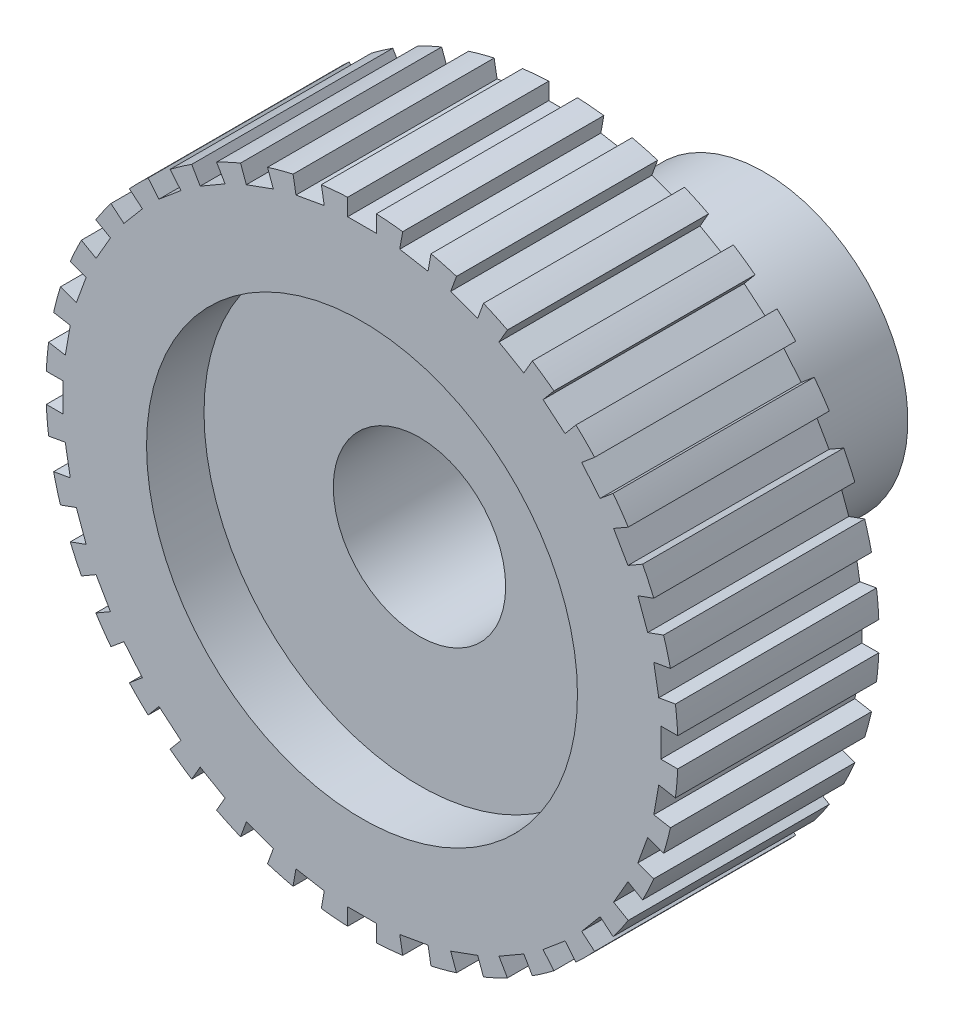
from build123d import *

# Parameters (mm, degrees)
ESQUISSE1_R                  = 11
BASE_EXTRUSION_DEPTH         = 7
ESQUISSE2_R                  = 7.5
ENL_V_MAT_EXTRU_1_DEPTH      = 2
ENL_V_START                  = -1
ESQUISSE3_R                  = 7.5
ENL_V_MAT_EXTRU_2_DEPTH      = 1
ESQUISSE4_R                  = 5
BOSS_EXTRU_1_DEPTH           = 8
ESQUISSE5_R                  = 3
ENL_V_MAT_EXTRU_3_DEPTH      = 18
ESQUISSE6_W                  = 1
ESQUISSE6_H                  = 1
ENL_V_MAT_EXTRU_4_DEPTH      = 18
R_P_TITION_CIRCULAIRE1_COUNT = 36


with BuildPart() as part:
    # Esquisse1 → Base-Extrusion (new body)
    with BuildSketch(Plane.XY):
        Circle(ESQUISSE1_R)
    extrude(amount=BASE_EXTRUSION_DEPTH)

    # Esquisse2 → Enl_v. mat.-Extru.1 (cut)
    with BuildSketch(Plane.XY.offset(7)):
        Circle(ESQUISSE2_R)
    extrude(amount=-ENL_V_MAT_EXTRU_1_DEPTH, mode=Mode.SUBTRACT)

    # Esquisse3 → Enl_v. mat.-Extru.2 (cut)
    with BuildSketch(Plane(origin=(0, 0, 0), x_dir=(-1, 0, 0), z_dir=(0, 0, -1)).offset(ENL_V_START)):
        with Locations(Location((0, 0, 0), (0, 0, 180))):
            Circle(ESQUISSE3_R)
    extrude(amount=ENL_V_MAT_EXTRU_2_DEPTH, mode=Mode.SUBTRACT)

    # Esquisse4 → Boss.-Extru.1 (add)
    with BuildSketch(Plane(origin=(0, 0, 1), x_dir=(-1, 0, 0), z_dir=(0, 0, -1))):
        Circle(ESQUISSE4_R)
    extrude(amount=BOSS_EXTRU_1_DEPTH)

    # Esquisse5 → Enl_v. mat.-Extru.3 (cut)
    with BuildSketch(Plane(origin=(0, 0, -7), x_dir=(-1, 0, 0), z_dir=(0, 0, -1))):
        Circle(ESQUISSE5_R)
    extrude(amount=-ENL_V_MAT_EXTRU_3_DEPTH, mode=Mode.SUBTRACT)

    # Esquisse6 → Enl_v. mat.-Extru.4 (cut)
    with BuildSketch(Plane.XY.offset(7)):
        with Locations((0, 10.9)):
            Rectangle(ESQUISSE6_W, ESQUISSE6_H)
    enl_v_mat_extru_4 = extrude(amount=-ENL_V_MAT_EXTRU_4_DEPTH, mode=Mode.SUBTRACT)

    # R_p_tition circulaire1: Enl_v. mat.-Extru.4 ×36 about axis
    r_p_tition_circulaire1_axis = Axis((0, 0, 0), (0, 0, -1))
    for i in range(1, R_P_TITION_CIRCULAIRE1_COUNT):
        add(enl_v_mat_extru_4.rotate(r_p_tition_circulaire1_axis, i * 360 / R_P_TITION_CIRCULAIRE1_COUNT), mode=Mode.SUBTRACT)


solid = part.part
